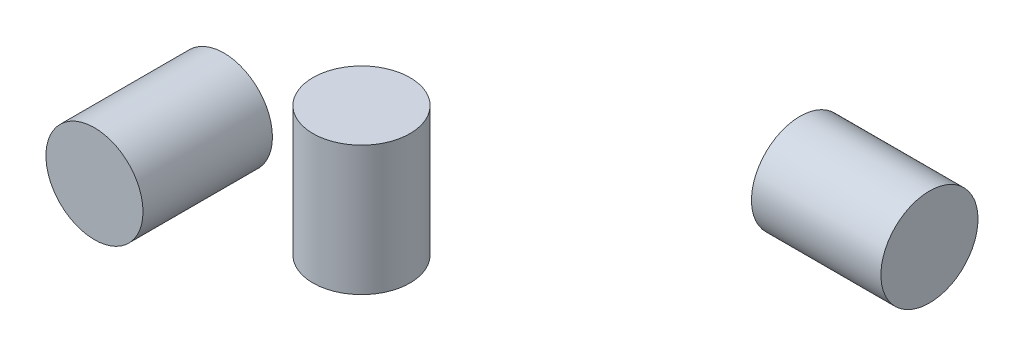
ISO-10303-21;
HEADER;
FILE_DESCRIPTION(('STEP AP214'),'2;1');
FILE_NAME('part.step','',(''),(''),'','','');
FILE_SCHEMA(('AUTOMOTIVE_DESIGN { 1 0 10303 214 1 1 1 1 }'));
ENDSEC;
DATA;
#1=APPLICATION_CONTEXT('core data for automotive mechanical design processes');
#2=APPLICATION_PROTOCOL_DEFINITION('international standard','automotive_design',2000,#1);
#3=PRODUCT_CONTEXT('',#1,'mechanical');
#4=PRODUCT('Part','Part','',(#3));
#5=PRODUCT_RELATED_PRODUCT_CATEGORY('part','',(#4));
#6=PRODUCT_DEFINITION_FORMATION('','',#4);
#7=PRODUCT_DEFINITION_CONTEXT('part definition',#1,'design');
#8=PRODUCT_DEFINITION('design','',#6,#7);
#9=PRODUCT_DEFINITION_SHAPE('','',#8);
#10=(LENGTH_UNIT() NAMED_UNIT(*) SI_UNIT(.MILLI.,.METRE.));
#11=(NAMED_UNIT(*) PLANE_ANGLE_UNIT() SI_UNIT($,.RADIAN.));
#12=(NAMED_UNIT(*) SI_UNIT($,.STERADIAN.) SOLID_ANGLE_UNIT());
#13=UNCERTAINTY_MEASURE_WITH_UNIT(LENGTH_MEASURE(1.E-05),#10,'distance_accuracy_value','');
#14=(GEOMETRIC_REPRESENTATION_CONTEXT(3) GLOBAL_UNCERTAINTY_ASSIGNED_CONTEXT((#13)) GLOBAL_UNIT_ASSIGNED_CONTEXT((#10,
#11,#12)) REPRESENTATION_CONTEXT('',''));
#15=CARTESIAN_POINT('',(0.,0.,0.));
#16=DIRECTION('',(0.,0.,1.));
#17=DIRECTION('',(1.,0.,0.));
#18=AXIS2_PLACEMENT_3D('',#15,#16,#17);
#19=CARTESIAN_POINT('',(40.,-105.951273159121,-178.03219345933));
#20=DIRECTION('',(-1.,0.,0.));
#21=DIRECTION('',(0.,0.,1.));
#22=AXIS2_PLACEMENT_3D('',#19,#20,#21);
#23=CYLINDRICAL_SURFACE('',#22,15.);
#24=CARTESIAN_POINT('',(40.,-105.951273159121,-178.03219345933));
#25=DIRECTION('',(1.,0.,0.));
#26=DIRECTION('',(0.,0.,-1.));
#27=AXIS2_PLACEMENT_3D('',#24,#25,#26);
#28=CIRCLE('',#27,15.);
#29=CARTESIAN_POINT('',(40.,-105.951273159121,-193.03219345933));
#30=VERTEX_POINT('',#29);
#31=EDGE_CURVE('E11',#30,#30,#28,.T.);
#32=ORIENTED_EDGE('',*,*,#31,.F.);
#33=EDGE_LOOP('',(#32));
#34=FACE_BOUND('',#33,.T.);
#35=CARTESIAN_POINT('',(0.,-105.951273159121,-178.03219345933));
#36=DIRECTION('',(1.,0.,0.));
#37=DIRECTION('',(0.,0.,-1.));
#38=AXIS2_PLACEMENT_3D('',#35,#36,#37);
#39=CIRCLE('',#38,15.);
#40=CARTESIAN_POINT('',(0.,-105.951273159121,-193.03219345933));
#41=VERTEX_POINT('',#40);
#42=EDGE_CURVE('E41',#41,#41,#39,.T.);
#43=ORIENTED_EDGE('',*,*,#42,.T.);
#44=EDGE_LOOP('',(#43));
#45=FACE_BOUND('',#44,.T.);
#46=ADVANCED_FACE('F38',(#34,#45),#23,.T.);
#47=CARTESIAN_POINT('',(40.,-105.951273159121,-178.03219345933));
#48=DIRECTION('',(1.,0.,0.));
#49=DIRECTION('',(0.,0.,-1.));
#50=AXIS2_PLACEMENT_3D('',#47,#48,#49);
#51=PLANE('',#50);
#52=ORIENTED_EDGE('',*,*,#31,.T.);
#53=EDGE_LOOP('',(#52));
#54=FACE_BOUND('',#53,.T.);
#55=ADVANCED_FACE('F53',(#54),#51,.T.);
#56=CARTESIAN_POINT('',(0.,-105.951273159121,-178.03219345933));
#57=DIRECTION('',(1.,0.,0.));
#58=DIRECTION('',(0.,0.,-1.));
#59=AXIS2_PLACEMENT_3D('',#56,#57,#58);
#60=PLANE('',#59);
#61=ORIENTED_EDGE('',*,*,#42,.F.);
#62=EDGE_LOOP('',(#61));
#63=FACE_BOUND('',#62,.T.);
#64=ADVANCED_FACE('F51',(#63),#60,.F.);
#65=CLOSED_SHELL('',(#46,#55,#64));
#66=MANIFOLD_SOLID_BREP('B2',#65);
#67=CARTESIAN_POINT('',(60.3428438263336,40.,17.8199894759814));
#68=DIRECTION('',(0.,-1.,0.));
#69=DIRECTION('',(0.,0.,-1.));
#70=AXIS2_PLACEMENT_3D('',#67,#68,#69);
#71=CYLINDRICAL_SURFACE('',#70,15.);
#72=CARTESIAN_POINT('',(60.3428438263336,40.,17.8199894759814));
#73=DIRECTION('',(0.,1.,0.));
#74=DIRECTION('',(0.,0.,1.));
#75=AXIS2_PLACEMENT_3D('',#72,#73,#74);
#76=CIRCLE('',#75,15.);
#77=CARTESIAN_POINT('',(60.3428438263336,40.,32.8199894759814));
#78=VERTEX_POINT('',#77);
#79=EDGE_CURVE('E37',#78,#78,#76,.T.);
#80=ORIENTED_EDGE('',*,*,#79,.F.);
#81=EDGE_LOOP('',(#80));
#82=FACE_BOUND('',#81,.T.);
#83=CARTESIAN_POINT('',(60.3428438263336,0.,17.8199894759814));
#84=DIRECTION('',(0.,1.,0.));
#85=DIRECTION('',(0.,0.,1.));
#86=AXIS2_PLACEMENT_3D('',#83,#84,#85);
#87=CIRCLE('',#86,15.);
#88=CARTESIAN_POINT('',(60.3428438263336,0.,32.8199894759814));
#89=VERTEX_POINT('',#88);
#90=EDGE_CURVE('E89',#89,#89,#87,.T.);
#91=ORIENTED_EDGE('',*,*,#90,.T.);
#92=EDGE_LOOP('',(#91));
#93=FACE_BOUND('',#92,.T.);
#94=ADVANCED_FACE('F86',(#82,#93),#71,.T.);
#95=CARTESIAN_POINT('',(60.3428438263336,40.,17.8199894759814));
#96=DIRECTION('',(0.,1.,0.));
#97=DIRECTION('',(0.,0.,1.));
#98=AXIS2_PLACEMENT_3D('',#95,#96,#97);
#99=PLANE('',#98);
#100=ORIENTED_EDGE('',*,*,#79,.T.);
#101=EDGE_LOOP('',(#100));
#102=FACE_BOUND('',#101,.T.);
#103=ADVANCED_FACE('F101',(#102),#99,.T.);
#104=CARTESIAN_POINT('',(60.3428438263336,0.,17.8199894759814));
#105=DIRECTION('',(0.,1.,0.));
#106=DIRECTION('',(0.,0.,1.));
#107=AXIS2_PLACEMENT_3D('',#104,#105,#106);
#108=PLANE('',#107);
#109=ORIENTED_EDGE('',*,*,#90,.F.);
#110=EDGE_LOOP('',(#109));
#111=FACE_BOUND('',#110,.T.);
#112=ADVANCED_FACE('F99',(#111),#108,.F.);
#113=CLOSED_SHELL('',(#94,#103,#112));
#114=MANIFOLD_SOLID_BREP('B6',#113);
#115=CARTESIAN_POINT('',(0.,0.,40.));
#116=DIRECTION('',(0.,0.,-1.));
#117=DIRECTION('',(-1.,0.,0.));
#118=AXIS2_PLACEMENT_3D('',#115,#116,#117);
#119=CYLINDRICAL_SURFACE('',#118,15.);
#120=CARTESIAN_POINT('',(0.,0.,40.));
#121=DIRECTION('',(0.,0.,1.));
#122=DIRECTION('',(1.,0.,0.));
#123=AXIS2_PLACEMENT_3D('',#120,#121,#122);
#124=CIRCLE('',#123,15.);
#125=CARTESIAN_POINT('',(15.,0.,40.));
#126=VERTEX_POINT('',#125);
#127=EDGE_CURVE('E85',#126,#126,#124,.T.);
#128=ORIENTED_EDGE('',*,*,#127,.F.);
#129=EDGE_LOOP('',(#128));
#130=FACE_BOUND('',#129,.T.);
#131=CARTESIAN_POINT('',(0.,0.,0.));
#132=DIRECTION('',(0.,0.,1.));
#133=DIRECTION('',(1.,0.,0.));
#134=AXIS2_PLACEMENT_3D('',#131,#132,#133);
#135=CIRCLE('',#134,15.);
#136=CARTESIAN_POINT('',(15.,0.,0.));
#137=VERTEX_POINT('',#136);
#138=EDGE_CURVE('E130',#137,#137,#135,.T.);
#139=ORIENTED_EDGE('',*,*,#138,.T.);
#140=EDGE_LOOP('',(#139));
#141=FACE_BOUND('',#140,.T.);
#142=ADVANCED_FACE('F127',(#130,#141),#119,.T.);
#143=CARTESIAN_POINT('',(0.,0.,40.));
#144=DIRECTION('',(0.,0.,1.));
#145=DIRECTION('',(1.,0.,0.));
#146=AXIS2_PLACEMENT_3D('',#143,#144,#145);
#147=PLANE('',#146);
#148=ORIENTED_EDGE('',*,*,#127,.T.);
#149=EDGE_LOOP('',(#148));
#150=FACE_BOUND('',#149,.T.);
#151=ADVANCED_FACE('F142',(#150),#147,.T.);
#152=CARTESIAN_POINT('',(0.,0.,0.));
#153=DIRECTION('',(0.,0.,1.));
#154=DIRECTION('',(1.,0.,0.));
#155=AXIS2_PLACEMENT_3D('',#152,#153,#154);
#156=PLANE('',#155);
#157=ORIENTED_EDGE('',*,*,#138,.F.);
#158=EDGE_LOOP('',(#157));
#159=FACE_BOUND('',#158,.T.);
#160=ADVANCED_FACE('F140',(#159),#156,.F.);
#161=CLOSED_SHELL('',(#142,#151,#160));
#162=MANIFOLD_SOLID_BREP('B32',#161);
#163=ADVANCED_BREP_SHAPE_REPRESENTATION('',(#18,#66,#114,#162),#14);
#164=SHAPE_DEFINITION_REPRESENTATION(#9,#163);
ENDSEC;
END-ISO-10303-21;
